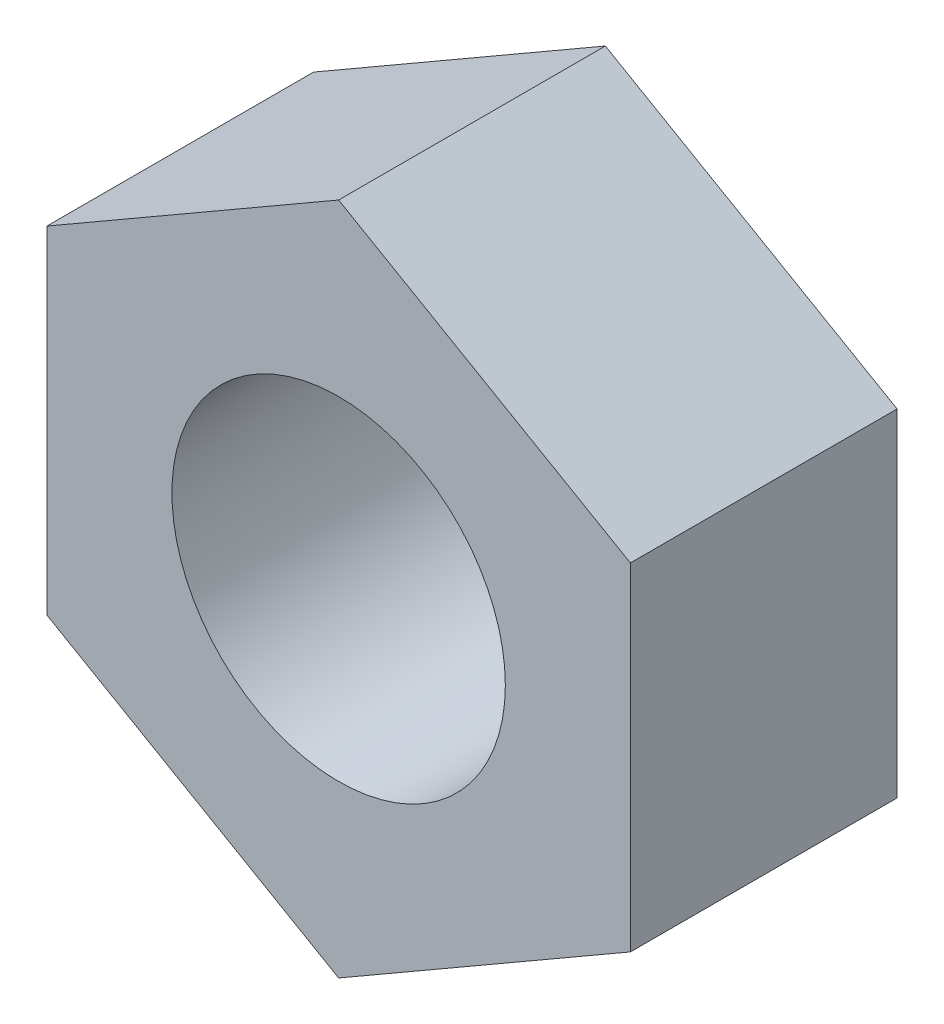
from build123d import *

# Parameters (mm, degrees)
SKETCH_1_R                   = 2
PLAIN_M4_AF7_HEIGHT3P2_DEPTH = 3.2


with BuildPart() as part:
    # Sketch 1 → Plain_M4_AF7_height3p2 (new body)
    with BuildSketch(Plane.XY):
        Polygon((3.5, 2.020725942), (0, 4.041451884), (-3.5, 2.020725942), (-3.5, -2.020725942), (0, -4.041451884), (3.5, -2.020725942), align=None)
        Circle(SKETCH_1_R, mode=Mode.SUBTRACT)
    extrude(amount=PLAIN_M4_AF7_HEIGHT3P2_DEPTH)


solid = part.part
